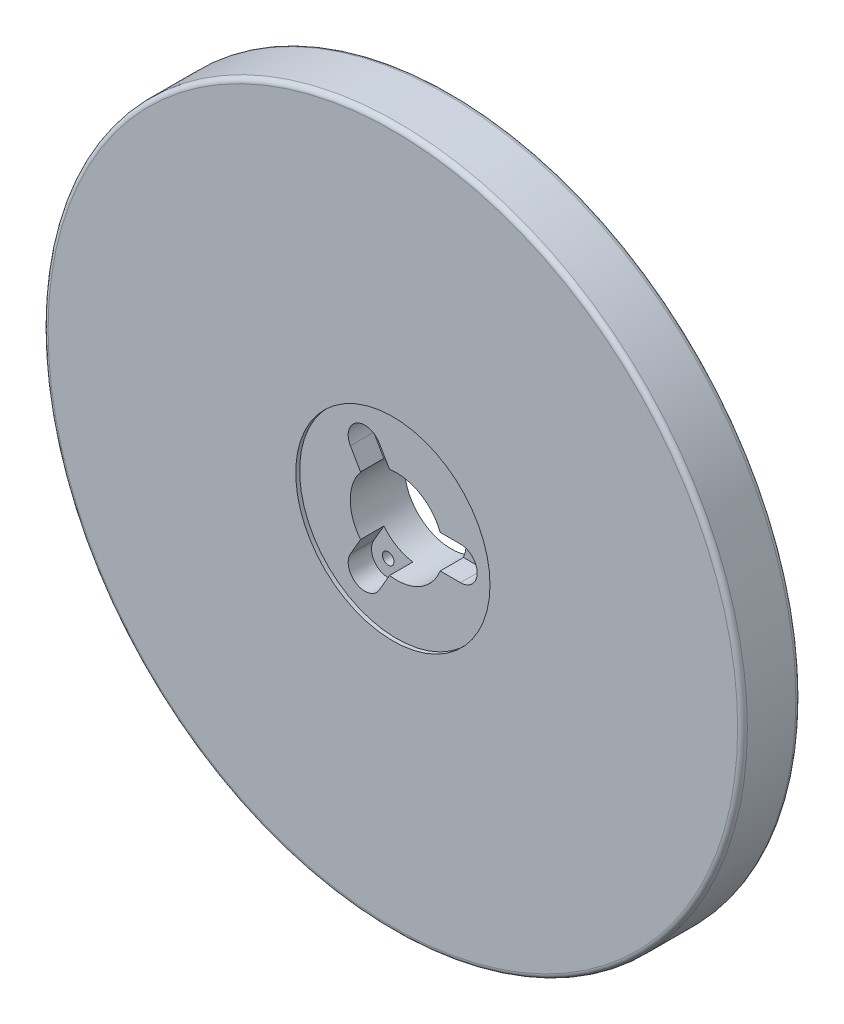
ISO-10303-21;
HEADER;
FILE_DESCRIPTION(('STEP AP214'),'2;1');
FILE_NAME('part.step','',(''),(''),'','','');
FILE_SCHEMA(('AUTOMOTIVE_DESIGN { 1 0 10303 214 1 1 1 1 }'));
ENDSEC;
DATA;
#1=APPLICATION_CONTEXT('core data for automotive mechanical design processes');
#2=APPLICATION_PROTOCOL_DEFINITION('international standard','automotive_design',2000,#1);
#3=PRODUCT_CONTEXT('',#1,'mechanical');
#4=PRODUCT('Part','Part','',(#3));
#5=PRODUCT_RELATED_PRODUCT_CATEGORY('part','',(#4));
#6=PRODUCT_DEFINITION_FORMATION('','',#4);
#7=PRODUCT_DEFINITION_CONTEXT('part definition',#1,'design');
#8=PRODUCT_DEFINITION('design','',#6,#7);
#9=PRODUCT_DEFINITION_SHAPE('','',#8);
#10=(LENGTH_UNIT() NAMED_UNIT(*) SI_UNIT(.MILLI.,.METRE.));
#11=(NAMED_UNIT(*) PLANE_ANGLE_UNIT() SI_UNIT($,.RADIAN.));
#12=(NAMED_UNIT(*) SI_UNIT($,.STERADIAN.) SOLID_ANGLE_UNIT());
#13=UNCERTAINTY_MEASURE_WITH_UNIT(LENGTH_MEASURE(1.E-05),#10,'distance_accuracy_value','');
#14=(GEOMETRIC_REPRESENTATION_CONTEXT(3) GLOBAL_UNCERTAINTY_ASSIGNED_CONTEXT((#13)) GLOBAL_UNIT_ASSIGNED_CONTEXT((#10,
#11,#12)) REPRESENTATION_CONTEXT('',''));
#15=CARTESIAN_POINT('',(0.,0.,0.));
#16=DIRECTION('',(0.,0.,1.));
#17=DIRECTION('',(1.,0.,0.));
#18=AXIS2_PLACEMENT_3D('',#15,#16,#17);
#19=CARTESIAN_POINT('',(0.,0.,-19.05));
#20=DIRECTION('',(0.,0.,1.));
#21=DIRECTION('',(1.,0.,0.));
#22=AXIS2_PLACEMENT_3D('',#19,#20,#21);
#23=CYLINDRICAL_SURFACE('',#22,30.4165);
#24=CARTESIAN_POINT('',(0.,0.,16.51));
#25=DIRECTION('',(0.,0.,1.));
#26=DIRECTION('',(1.,0.,0.));
#27=AXIS2_PLACEMENT_3D('',#24,#25,#26);
#28=CIRCLE('',#27,30.4165);
#29=CARTESIAN_POINT('',(-23.6526840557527,-19.1236505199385,16.51));
#30=VERTEX_POINT('',#29);
#31=CARTESIAN_POINT('',(-23.652684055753,19.123650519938,16.51));
#32=VERTEX_POINT('',#31);
#33=EDGE_CURVE('E228',#30,#32,#28,.F.);
#34=ORIENTED_EDGE('',*,*,#33,.F.);
#35=DIRECTION('',(0.,0.,1.));
#36=VECTOR('',#35,1.);
#37=CARTESIAN_POINT('',(-23.6526840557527,-19.1236505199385,1.27));
#38=LINE('',#37,#36);
#39=CARTESIAN_POINT('',(-23.6526840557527,-19.1236505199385,1.27));
#40=VERTEX_POINT('',#39);
#41=EDGE_CURVE('E151',#40,#30,#38,.T.);
#42=ORIENTED_EDGE('',*,*,#41,.F.);
#43=CARTESIAN_POINT('',(0.,0.,1.27));
#44=DIRECTION('',(0.,0.,1.));
#45=DIRECTION('',(1.,0.,0.));
#46=AXIS2_PLACEMENT_3D('',#43,#44,#45);
#47=CIRCLE('',#46,30.4165);
#48=CARTESIAN_POINT('',(-4.73522513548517,-30.0456505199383,1.27));
#49=VERTEX_POINT('',#48);
#50=EDGE_CURVE('E11',#49,#40,#47,.F.);
#51=ORIENTED_EDGE('',*,*,#50,.F.);
#52=DIRECTION('',(0.,0.,1.));
#53=VECTOR('',#52,1.);
#54=CARTESIAN_POINT('',(-4.73522513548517,-30.0456505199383,1.27));
#55=LINE('',#54,#53);
#56=CARTESIAN_POINT('',(-4.73522513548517,-30.0456505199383,16.51));
#57=VERTEX_POINT('',#56);
#58=EDGE_CURVE('E128',#49,#57,#55,.T.);
#59=ORIENTED_EDGE('',*,*,#58,.T.);
#60=CARTESIAN_POINT('',(28.3879091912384,-10.922,16.51));
#61=VERTEX_POINT('',#60);
#62=EDGE_CURVE('E213',#61,#57,#28,.F.);
#63=ORIENTED_EDGE('',*,*,#62,.F.);
#64=DIRECTION('',(0.,0.,1.));
#65=VECTOR('',#64,1.);
#66=CARTESIAN_POINT('',(28.3879091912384,-10.922,1.27));
#67=LINE('',#66,#65);
#68=CARTESIAN_POINT('',(28.3879091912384,-10.922,1.27));
#69=VERTEX_POINT('',#68);
#70=EDGE_CURVE('E197',#69,#61,#67,.T.);
#71=ORIENTED_EDGE('',*,*,#70,.F.);
#72=CARTESIAN_POINT('',(0.,0.,1.27));
#73=DIRECTION('',(0.,0.,1.));
#74=DIRECTION('',(1.,0.,0.));
#75=AXIS2_PLACEMENT_3D('',#72,#73,#74);
#76=CIRCLE('',#75,30.4165);
#77=CARTESIAN_POINT('',(28.3879091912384,10.9220000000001,1.27));
#78=VERTEX_POINT('',#77);
#79=EDGE_CURVE('E236',#78,#69,#76,.F.);
#80=ORIENTED_EDGE('',*,*,#79,.F.);
#81=DIRECTION('',(0.,0.,1.));
#82=VECTOR('',#81,1.);
#83=CARTESIAN_POINT('',(28.3879091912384,10.9220000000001,1.27));
#84=LINE('',#83,#82);
#85=CARTESIAN_POINT('',(28.3879091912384,10.9220000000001,16.51));
#86=VERTEX_POINT('',#85);
#87=EDGE_CURVE('E199',#78,#86,#84,.T.);
#88=ORIENTED_EDGE('',*,*,#87,.T.);
#89=CARTESIAN_POINT('',(-4.73522513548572,30.0456505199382,16.51));
#90=VERTEX_POINT('',#89);
#91=EDGE_CURVE('E208',#90,#86,#28,.F.);
#92=ORIENTED_EDGE('',*,*,#91,.F.);
#93=DIRECTION('',(0.,0.,1.));
#94=VECTOR('',#93,1.);
#95=CARTESIAN_POINT('',(-4.73522513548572,30.0456505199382,1.27));
#96=LINE('',#95,#94);
#97=CARTESIAN_POINT('',(-4.73522513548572,30.0456505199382,1.27));
#98=VERTEX_POINT('',#97);
#99=EDGE_CURVE('E166',#98,#90,#96,.T.);
#100=ORIENTED_EDGE('',*,*,#99,.F.);
#101=CARTESIAN_POINT('',(0.,0.,1.27));
#102=DIRECTION('',(0.,0.,1.));
#103=DIRECTION('',(1.,0.,0.));
#104=AXIS2_PLACEMENT_3D('',#101,#102,#103);
#105=CIRCLE('',#104,30.4165);
#106=CARTESIAN_POINT('',(-23.652684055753,19.123650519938,1.27));
#107=VERTEX_POINT('',#106);
#108=EDGE_CURVE('E244',#107,#98,#105,.F.);
#109=ORIENTED_EDGE('',*,*,#108,.F.);
#110=DIRECTION('',(0.,0.,1.));
#111=VECTOR('',#110,1.);
#112=CARTESIAN_POINT('',(-23.652684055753,19.123650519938,1.27));
#113=LINE('',#112,#111);
#114=EDGE_CURVE('E168',#107,#32,#113,.T.);
#115=ORIENTED_EDGE('',*,*,#114,.T.);
#116=EDGE_LOOP('',(#34,#42,#51,#59,#63,#71,#80,#88,#92,#100,#109,#115));
#117=FACE_BOUND('',#116,.T.);
#118=CARTESIAN_POINT('',(0.,0.,-19.05));
#119=DIRECTION('',(0.,0.,1.));
#120=DIRECTION('',(1.,0.,0.));
#121=AXIS2_PLACEMENT_3D('',#118,#119,#120);
#122=CIRCLE('',#121,30.4165);
#123=CARTESIAN_POINT('',(30.4165,0.,-19.05));
#124=VERTEX_POINT('',#123);
#125=EDGE_CURVE('E209',#124,#124,#122,.T.);
#126=ORIENTED_EDGE('',*,*,#125,.F.);
#127=EDGE_LOOP('',(#126));
#128=FACE_BOUND('',#127,.T.);
#129=ADVANCED_FACE('F32',(#117,#128),#23,.F.);
#130=CARTESIAN_POINT('',(0.,0.,19.05));
#131=DIRECTION('',(0.,0.,-1.));
#132=DIRECTION('',(-1.,0.,0.));
#133=AXIS2_PLACEMENT_3D('',#130,#131,#132);
#134=CYLINDRICAL_SURFACE('',#133,228.6);
#135=CARTESIAN_POINT('',(0.,0.,-15.875));
#136=DIRECTION('',(0.,0.,1.));
#137=DIRECTION('',(1.,0.,0.));
#138=AXIS2_PLACEMENT_3D('',#135,#136,#137);
#139=CIRCLE('',#138,228.6);
#140=CARTESIAN_POINT('',(-228.6,0.,-15.875));
#141=VERTEX_POINT('',#140);
#142=EDGE_CURVE('E219',#141,#141,#139,.T.);
#143=CARTESIAN_POINT('',(0.,0.,15.875));
#144=DIRECTION('',(0.,0.,1.));
#145=DIRECTION('',(1.,0.,0.));
#146=AXIS2_PLACEMENT_3D('',#143,#144,#145);
#147=CIRCLE('',#146,228.6);
#148=CARTESIAN_POINT('',(-228.6,0.,15.875));
#149=VERTEX_POINT('',#148);
#150=EDGE_CURVE('E216',#149,#149,#147,.F.);
#151=CARTESIAN_POINT('',(-228.6,0.,-15.875));
#152=CARTESIAN_POINT('',(-228.6,0.,-15.5442708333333));
#153=CARTESIAN_POINT('',(-228.6,0.,-15.2135416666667));
#154=CARTESIAN_POINT('',(-228.6,0.,-14.5520833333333));
#155=CARTESIAN_POINT('',(-228.6,0.,-14.2213541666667));
#156=CARTESIAN_POINT('',(-228.6,0.,-13.5598958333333));
#157=CARTESIAN_POINT('',(-228.6,0.,-13.2291666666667));
#158=CARTESIAN_POINT('',(-228.6,0.,-12.5677083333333));
#159=CARTESIAN_POINT('',(-228.6,0.,-12.2369791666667));
#160=CARTESIAN_POINT('',(-228.6,0.,-11.5755208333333));
#161=CARTESIAN_POINT('',(-228.6,0.,-11.2447916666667));
#162=CARTESIAN_POINT('',(-228.6,0.,-10.5833333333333));
#163=CARTESIAN_POINT('',(-228.6,0.,-10.2526041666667));
#164=CARTESIAN_POINT('',(-228.6,0.,-9.59114583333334));
#165=CARTESIAN_POINT('',(-228.6,0.,-9.26041666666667));
#166=CARTESIAN_POINT('',(-228.6,0.,-8.59895833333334));
#167=CARTESIAN_POINT('',(-228.6,0.,-8.26822916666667));
#168=CARTESIAN_POINT('',(-228.6,0.,-7.60677083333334));
#169=CARTESIAN_POINT('',(-228.6,0.,-7.27604166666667));
#170=CARTESIAN_POINT('',(-228.6,0.,-6.61458333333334));
#171=CARTESIAN_POINT('',(-228.6,0.,-6.28385416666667));
#172=CARTESIAN_POINT('',(-228.6,0.,-5.62239583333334));
#173=CARTESIAN_POINT('',(-228.6,0.,-5.29166666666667));
#174=CARTESIAN_POINT('',(-228.6,0.,-4.63020833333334));
#175=CARTESIAN_POINT('',(-228.6,0.,-4.29947916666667));
#176=CARTESIAN_POINT('',(-228.6,0.,-3.63802083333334));
#177=CARTESIAN_POINT('',(-228.6,0.,-3.30729166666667));
#178=CARTESIAN_POINT('',(-228.6,0.,-2.64583333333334));
#179=CARTESIAN_POINT('',(-228.6,0.,-2.31510416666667));
#180=CARTESIAN_POINT('',(-228.6,0.,-1.65364583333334));
#181=CARTESIAN_POINT('',(-228.6,0.,-1.32291666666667));
#182=CARTESIAN_POINT('',(-228.6,0.,-0.661458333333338));
#183=CARTESIAN_POINT('',(-228.6,0.,-0.330729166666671));
#184=CARTESIAN_POINT('',(-228.6,0.,0.330729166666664));
#185=CARTESIAN_POINT('',(-228.6,0.,0.661458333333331));
#186=CARTESIAN_POINT('',(-228.6,0.,1.32291666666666));
#187=CARTESIAN_POINT('',(-228.6,0.,1.65364583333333));
#188=CARTESIAN_POINT('',(-228.6,0.,2.31510416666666));
#189=CARTESIAN_POINT('',(-228.6,0.,2.64583333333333));
#190=CARTESIAN_POINT('',(-228.6,0.,3.30729166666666));
#191=CARTESIAN_POINT('',(-228.6,0.,3.63802083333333));
#192=CARTESIAN_POINT('',(-228.6,0.,4.29947916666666));
#193=CARTESIAN_POINT('',(-228.6,0.,4.63020833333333));
#194=CARTESIAN_POINT('',(-228.6,0.,5.29166666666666));
#195=CARTESIAN_POINT('',(-228.6,0.,5.62239583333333));
#196=CARTESIAN_POINT('',(-228.6,0.,6.28385416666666));
#197=CARTESIAN_POINT('',(-228.6,0.,6.61458333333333));
#198=CARTESIAN_POINT('',(-228.6,0.,7.27604166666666));
#199=CARTESIAN_POINT('',(-228.6,0.,7.60677083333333));
#200=CARTESIAN_POINT('',(-228.6,0.,8.26822916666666));
#201=CARTESIAN_POINT('',(-228.6,0.,8.59895833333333));
#202=CARTESIAN_POINT('',(-228.6,0.,9.26041666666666));
#203=CARTESIAN_POINT('',(-228.6,0.,9.59114583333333));
#204=CARTESIAN_POINT('',(-228.6,0.,10.2526041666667));
#205=CARTESIAN_POINT('',(-228.6,0.,10.5833333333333));
#206=CARTESIAN_POINT('',(-228.6,0.,11.2447916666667));
#207=CARTESIAN_POINT('',(-228.6,0.,11.5755208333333));
#208=CARTESIAN_POINT('',(-228.6,0.,12.2369791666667));
#209=CARTESIAN_POINT('',(-228.6,0.,12.5677083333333));
#210=CARTESIAN_POINT('',(-228.6,0.,13.2291666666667));
#211=CARTESIAN_POINT('',(-228.6,0.,13.5598958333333));
#212=CARTESIAN_POINT('',(-228.6,0.,14.2213541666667));
#213=CARTESIAN_POINT('',(-228.6,0.,14.5520833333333));
#214=CARTESIAN_POINT('',(-228.6,0.,15.2135416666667));
#215=CARTESIAN_POINT('',(-228.6,0.,15.5442708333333));
#216=CARTESIAN_POINT('',(-228.6,0.,15.875));
#217=B_SPLINE_CURVE_WITH_KNOTS('',3,(#151,#152,#153,#154,#155,#156,#157,#158,#159,#160,#161,
#162,#163,#164,#165,#166,#167,#168,#169,#170,#171,#172,#173,#174,#175,#176,#177,#178,#179,#180,
#181,#182,#183,#184,#185,#186,#187,#188,#189,#190,#191,#192,#193,#194,#195,#196,#197,#198,#199,
#200,#201,#202,#203,#204,#205,#206,#207,#208,#209,#210,#211,#212,#213,#214,#215,#216),
.UNSPECIFIED.,.F.,.F.,(4,2,2,2,2,2,2,2,2,2,2,2,2,2,2,2,2,2,2,2,2,2,2,2,2,2,2,2,2,2,2,2,4),(0.,
0.992187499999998,1.984375,2.9765625,3.96875,4.9609375,5.953125,6.9453125,7.9375,8.9296875,
9.921875,10.9140625,11.90625,12.8984375,13.890625,14.8828125,15.875,16.8671875,17.859375,
18.8515625,19.84375,20.8359375,21.828125,22.8203125,23.8125,24.8046875,25.796875,26.7890625,
27.78125,28.7734375,29.765625,30.7578125,31.75),.UNSPECIFIED.);
#218=EDGE_CURVE('BSEAM34',#141,#149,#217,.T.);
#219=ORIENTED_EDGE('',*,*,#142,.T.);
#220=ORIENTED_EDGE('',*,*,#150,.T.);
#221=ORIENTED_EDGE('',*,*,#218,.T.);
#222=ORIENTED_EDGE('',*,*,#218,.F.);
#223=EDGE_LOOP('',(#219,#221,#220,#222));
#224=FACE_BOUND('',#223,.T.);
#225=ADVANCED_FACE('F34',(#224),#134,.T.);
#226=CARTESIAN_POINT('',(0.,0.,19.05));
#227=DIRECTION('',(0.,0.,1.));
#228=DIRECTION('',(1.,0.,0.));
#229=AXIS2_PLACEMENT_3D('',#226,#227,#228);
#230=PLANE('',#229);
#231=CARTESIAN_POINT('',(0.,0.,19.05));
#232=DIRECTION('',(0.,0.,1.));
#233=DIRECTION('',(1.,0.,0.));
#234=AXIS2_PLACEMENT_3D('',#231,#232,#233);
#235=CIRCLE('',#234,63.5);
#236=CARTESIAN_POINT('',(63.5,0.,19.05));
#237=VERTEX_POINT('',#236);
#238=EDGE_CURVE('E196',#237,#237,#235,.T.);
#239=ORIENTED_EDGE('',*,*,#238,.F.);
#240=EDGE_LOOP('',(#239));
#241=FACE_BOUND('',#240,.T.);
#242=CARTESIAN_POINT('',(0.,0.,19.05));
#243=DIRECTION('',(0.,0.,1.));
#244=DIRECTION('',(1.,0.,0.));
#245=AXIS2_PLACEMENT_3D('',#242,#243,#244);
#246=CIRCLE('',#245,225.425);
#247=CARTESIAN_POINT('',(225.425,0.,19.05));
#248=VERTEX_POINT('',#247);
#249=EDGE_CURVE('E212',#248,#248,#246,.T.);
#250=ORIENTED_EDGE('',*,*,#249,.T.);
#251=EDGE_LOOP('',(#250));
#252=FACE_BOUND('',#251,.T.);
#253=ADVANCED_FACE('F298',(#241,#252),#230,.T.);
#254=CARTESIAN_POINT('',(0.,0.,-19.05));
#255=DIRECTION('',(0.,0.,1.));
#256=DIRECTION('',(1.,0.,0.));
#257=AXIS2_PLACEMENT_3D('',#254,#255,#256);
#258=PLANE('',#257);
#259=CARTESIAN_POINT('',(-20.8279999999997,-36.0751542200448,-19.05));
#260=DIRECTION('',(0.,0.,-1.));
#261=DIRECTION('',(0.499999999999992,0.866025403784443,0.));
#262=AXIS2_PLACEMENT_3D('',#259,#260,#261);
#263=CIRCLE('',#262,9.525);
#264=CARTESIAN_POINT('',(-16.0654999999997,-27.8262622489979,-19.05));
#265=VERTEX_POINT('',#264);
#266=EDGE_CURVE('E566',#265,#265,#263,.T.);
#267=ORIENTED_EDGE('',*,*,#266,.F.);
#268=EDGE_LOOP('',(#267));
#269=FACE_BOUND('',#268,.T.);
#270=CARTESIAN_POINT('',(-20.8280000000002,36.0751542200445,-19.05));
#271=DIRECTION('',(0.,0.,-1.));
#272=DIRECTION('',(0.500000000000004,-0.866025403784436,0.));
#273=AXIS2_PLACEMENT_3D('',#270,#271,#272);
#274=CIRCLE('',#273,9.525);
#275=CARTESIAN_POINT('',(-16.0655000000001,27.8262622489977,-19.05));
#276=VERTEX_POINT('',#275);
#277=EDGE_CURVE('E143',#276,#276,#274,.T.);
#278=ORIENTED_EDGE('',*,*,#277,.F.);
#279=EDGE_LOOP('',(#278));
#280=FACE_BOUND('',#279,.T.);
#281=CARTESIAN_POINT('',(41.656,0.,-19.05));
#282=DIRECTION('',(0.,0.,-1.));
#283=DIRECTION('',(-1.,0.,0.));
#284=AXIS2_PLACEMENT_3D('',#281,#282,#283);
#285=CIRCLE('',#284,9.525);
#286=CARTESIAN_POINT('',(32.131,0.,-19.05));
#287=VERTEX_POINT('',#286);
#288=EDGE_CURVE('E177',#287,#287,#285,.T.);
#289=ORIENTED_EDGE('',*,*,#288,.F.);
#290=EDGE_LOOP('',(#289));
#291=FACE_BOUND('',#290,.T.);
#292=CARTESIAN_POINT('',(0.,0.,-19.05));
#293=DIRECTION('',(0.,0.,1.));
#294=DIRECTION('',(1.,0.,0.));
#295=AXIS2_PLACEMENT_3D('',#292,#293,#294);
#296=CIRCLE('',#295,225.425);
#297=CARTESIAN_POINT('',(225.425,0.,-19.05));
#298=VERTEX_POINT('',#297);
#299=EDGE_CURVE('E222',#298,#298,#296,.F.);
#300=ORIENTED_EDGE('',*,*,#299,.T.);
#301=EDGE_LOOP('',(#300));
#302=FACE_BOUND('',#301,.T.);
#303=ORIENTED_EDGE('',*,*,#125,.T.);
#304=EDGE_LOOP('',(#303));
#305=FACE_BOUND('',#304,.T.);
#306=ADVANCED_FACE('F304',(#269,#280,#291,#302,#305),#258,.F.);
#307=CARTESIAN_POINT('',(0.,0.,15.875));
#308=DIRECTION('',(0.,0.,1.));
#309=DIRECTION('',(1.,0.,0.));
#310=AXIS2_PLACEMENT_3D('',#307,#308,#309);
#311=TOROIDAL_SURFACE('',#310,225.425,3.175);
#312=ORIENTED_EDGE('',*,*,#150,.F.);
#313=EDGE_LOOP('',(#312));
#314=FACE_BOUND('',#313,.T.);
#315=ORIENTED_EDGE('',*,*,#249,.F.);
#316=EDGE_LOOP('',(#315));
#317=FACE_BOUND('',#316,.T.);
#318=ADVANCED_FACE('F302',(#314,#317),#311,.T.);
#319=CARTESIAN_POINT('',(0.,0.,-15.875));
#320=DIRECTION('',(0.,0.,1.));
#321=DIRECTION('',(1.,0.,0.));
#322=AXIS2_PLACEMENT_3D('',#319,#320,#321);
#323=TOROIDAL_SURFACE('',#322,225.425,3.175);
#324=ORIENTED_EDGE('',*,*,#299,.F.);
#325=EDGE_LOOP('',(#324));
#326=FACE_BOUND('',#325,.T.);
#327=ORIENTED_EDGE('',*,*,#142,.F.);
#328=EDGE_LOOP('',(#327));
#329=FACE_BOUND('',#328,.T.);
#330=ADVANCED_FACE('F316',(#326,#329),#323,.T.);
#331=CARTESIAN_POINT('',(0.,0.,16.51));
#332=DIRECTION('',(0.,0.,1.));
#333=DIRECTION('',(1.,0.,0.));
#334=AXIS2_PLACEMENT_3D('',#331,#332,#333);
#335=PLANE('',#334);
#336=DIRECTION('',(-0.499999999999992,-0.866025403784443,0.));
#337=VECTOR('',#336,1.);
#338=CARTESIAN_POINT('',(-9.45872946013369,5.46099999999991,16.51));
#339=LINE('',#338,#337);
#340=CARTESIAN_POINT('',(-30.2867294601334,-30.6141542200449,16.51));
#341=VERTEX_POINT('',#340);
#342=EDGE_CURVE('E40',#30,#341,#339,.T.);
#343=ORIENTED_EDGE('',*,*,#342,.F.);
#344=ORIENTED_EDGE('',*,*,#33,.T.);
#345=DIRECTION('',(0.499999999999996,-0.866025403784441,0.));
#346=VECTOR('',#345,1.);
#347=CARTESIAN_POINT('',(-9.458729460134,-5.46100000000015,16.51));
#348=LINE('',#347,#346);
#349=CARTESIAN_POINT('',(-30.2867294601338,30.6141542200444,16.51));
#350=VERTEX_POINT('',#349);
#351=EDGE_CURVE('E238',#350,#32,#348,.T.);
#352=ORIENTED_EDGE('',*,*,#351,.F.);
#353=CARTESIAN_POINT('',(-20.8280000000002,36.0751542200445,16.51));
#354=DIRECTION('',(0.,0.,1.));
#355=DIRECTION('',(1.,0.,0.));
#356=AXIS2_PLACEMENT_3D('',#353,#354,#355);
#357=CIRCLE('',#356,10.922);
#358=CARTESIAN_POINT('',(-11.3692705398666,41.5361542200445,16.51));
#359=VERTEX_POINT('',#358);
#360=EDGE_CURVE('E240',#359,#350,#357,.T.);
#361=ORIENTED_EDGE('',*,*,#360,.F.);
#362=DIRECTION('',(-0.500000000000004,0.866025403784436,0.));
#363=VECTOR('',#362,1.);
#364=CARTESIAN_POINT('',(9.45872946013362,5.46100000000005,16.51));
#365=LINE('',#364,#363);
#366=EDGE_CURVE('E242',#90,#359,#365,.T.);
#367=ORIENTED_EDGE('',*,*,#366,.F.);
#368=ORIENTED_EDGE('',*,*,#91,.T.);
#369=DIRECTION('',(-1.,0.,0.));
#370=VECTOR('',#369,1.);
#371=CARTESIAN_POINT('',(1.01387016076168E-13,10.9220000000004,16.51));
#372=LINE('',#371,#370);
#373=CARTESIAN_POINT('',(41.656,10.922,16.51));
#374=VERTEX_POINT('',#373);
#375=EDGE_CURVE('E225',#374,#86,#372,.T.);
#376=ORIENTED_EDGE('',*,*,#375,.F.);
#377=CARTESIAN_POINT('',(41.656,0.,16.51));
#378=DIRECTION('',(0.,0.,1.));
#379=DIRECTION('',(1.,0.,0.));
#380=AXIS2_PLACEMENT_3D('',#377,#378,#379);
#381=CIRCLE('',#380,10.922);
#382=CARTESIAN_POINT('',(41.656,-10.922,16.51));
#383=VERTEX_POINT('',#382);
#384=EDGE_CURVE('E231',#383,#374,#381,.T.);
#385=ORIENTED_EDGE('',*,*,#384,.F.);
#386=DIRECTION('',(1.,0.,0.));
#387=VECTOR('',#386,1.);
#388=CARTESIAN_POINT('',(0.,-10.922,16.51));
#389=LINE('',#388,#387);
#390=EDGE_CURVE('E234',#61,#383,#389,.T.);
#391=ORIENTED_EDGE('',*,*,#390,.F.);
#392=ORIENTED_EDGE('',*,*,#62,.T.);
#393=DIRECTION('',(0.5,0.866025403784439,0.));
#394=VECTOR('',#393,1.);
#395=CARTESIAN_POINT('',(9.45872946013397,-5.46100000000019,16.51));
#396=LINE('',#395,#394);
#397=CARTESIAN_POINT('',(-11.369270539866,-41.5361542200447,16.51));
#398=VERTEX_POINT('',#397);
#399=EDGE_CURVE('E246',#398,#57,#396,.T.);
#400=ORIENTED_EDGE('',*,*,#399,.F.);
#401=CARTESIAN_POINT('',(-20.8279999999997,-36.0751542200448,16.51));
#402=DIRECTION('',(0.,0.,1.));
#403=DIRECTION('',(1.,0.,0.));
#404=AXIS2_PLACEMENT_3D('',#401,#402,#403);
#405=CIRCLE('',#404,10.922);
#406=EDGE_CURVE('E126',#341,#398,#405,.T.);
#407=ORIENTED_EDGE('',*,*,#406,.F.);
#408=EDGE_LOOP('',(#343,#344,#352,#361,#367,#368,#376,#385,#391,#392,#400,#407));
#409=FACE_BOUND('',#408,.T.);
#410=CARTESIAN_POINT('',(0.,0.,16.51));
#411=DIRECTION('',(0.,0.,1.));
#412=DIRECTION('',(1.,0.,0.));
#413=AXIS2_PLACEMENT_3D('',#410,#411,#412);
#414=CIRCLE('',#413,63.5);
#415=CARTESIAN_POINT('',(63.5,0.,16.51));
#416=VERTEX_POINT('',#415);
#417=EDGE_CURVE('E205',#416,#416,#414,.T.);
#418=ORIENTED_EDGE('',*,*,#417,.T.);
#419=EDGE_LOOP('',(#418));
#420=FACE_BOUND('',#419,.T.);
#421=ADVANCED_FACE('F254',(#409,#420),#335,.T.);
#422=CARTESIAN_POINT('',(0.,0.,16.51));
#423=DIRECTION('',(0.,0.,1.));
#424=DIRECTION('',(1.,0.,0.));
#425=AXIS2_PLACEMENT_3D('',#422,#423,#424);
#426=CYLINDRICAL_SURFACE('',#425,63.5);
#427=ORIENTED_EDGE('',*,*,#417,.F.);
#428=EDGE_LOOP('',(#427));
#429=FACE_BOUND('',#428,.T.);
#430=ORIENTED_EDGE('',*,*,#238,.T.);
#431=EDGE_LOOP('',(#430));
#432=FACE_BOUND('',#431,.T.);
#433=ADVANCED_FACE('F288',(#429,#432),#426,.F.);
#434=CARTESIAN_POINT('',(41.656,0.,1.27));
#435=DIRECTION('',(0.,0.,1.));
#436=DIRECTION('',(1.,0.,0.));
#437=AXIS2_PLACEMENT_3D('',#434,#435,#436);
#438=PLANE('',#437);
#439=CARTESIAN_POINT('',(41.656,0.,1.27));
#440=DIRECTION('',(0.,0.,1.));
#441=DIRECTION('',(1.,0.,0.));
#442=AXIS2_PLACEMENT_3D('',#439,#440,#441);
#443=CIRCLE('',#442,3.81);
#444=CARTESIAN_POINT('',(37.846,0.,1.27));
#445=VERTEX_POINT('',#444);
#446=EDGE_CURVE('E174',#445,#445,#443,.T.);
#447=ORIENTED_EDGE('',*,*,#446,.F.);
#448=EDGE_LOOP('',(#447));
#449=FACE_BOUND('',#448,.T.);
#450=ORIENTED_EDGE('',*,*,#79,.T.);
#451=DIRECTION('',(1.,0.,0.));
#452=VECTOR('',#451,1.);
#453=CARTESIAN_POINT('',(41.656,-10.922,1.27));
#454=LINE('',#453,#452);
#455=CARTESIAN_POINT('',(41.656,-10.922,1.27));
#456=VERTEX_POINT('',#455);
#457=EDGE_CURVE('E189',#69,#456,#454,.T.);
#458=ORIENTED_EDGE('',*,*,#457,.T.);
#459=CARTESIAN_POINT('',(41.656,0.,1.27));
#460=DIRECTION('',(0.,0.,1.));
#461=DIRECTION('',(1.,0.,0.));
#462=AXIS2_PLACEMENT_3D('',#459,#460,#461);
#463=CIRCLE('',#462,10.922);
#464=CARTESIAN_POINT('',(41.656,10.922,1.27));
#465=VERTEX_POINT('',#464);
#466=EDGE_CURVE('E183',#456,#465,#463,.T.);
#467=ORIENTED_EDGE('',*,*,#466,.T.);
#468=DIRECTION('',(-1.,0.,0.));
#469=VECTOR('',#468,1.);
#470=CARTESIAN_POINT('',(41.656,10.922,1.27));
#471=LINE('',#470,#469);
#472=EDGE_CURVE('E186',#465,#78,#471,.T.);
#473=ORIENTED_EDGE('',*,*,#472,.T.);
#474=EDGE_LOOP('',(#450,#458,#467,#473));
#475=FACE_BOUND('',#474,.T.);
#476=ADVANCED_FACE('F275',(#449,#475),#438,.T.);
#477=CARTESIAN_POINT('',(41.656,0.,1.27));
#478=DIRECTION('',(0.,0.,1.));
#479=DIRECTION('',(1.,0.,0.));
#480=AXIS2_PLACEMENT_3D('',#477,#478,#479);
#481=CYLINDRICAL_SURFACE('',#480,10.922);
#482=ORIENTED_EDGE('',*,*,#384,.T.);
#483=DIRECTION('',(0.,0.,1.));
#484=VECTOR('',#483,1.);
#485=CARTESIAN_POINT('',(41.656,10.922,1.27));
#486=LINE('',#485,#484);
#487=EDGE_CURVE('E192',#465,#374,#486,.T.);
#488=ORIENTED_EDGE('',*,*,#487,.F.);
#489=ORIENTED_EDGE('',*,*,#466,.F.);
#490=DIRECTION('',(0.,0.,1.));
#491=VECTOR('',#490,1.);
#492=CARTESIAN_POINT('',(41.656,-10.922,1.27));
#493=LINE('',#492,#491);
#494=EDGE_CURVE('E193',#456,#383,#493,.T.);
#495=ORIENTED_EDGE('',*,*,#494,.T.);
#496=EDGE_LOOP('',(#482,#488,#489,#495));
#497=FACE_BOUND('',#496,.T.);
#498=ADVANCED_FACE('F280',(#497),#481,.F.);
#499=CARTESIAN_POINT('',(41.656,-10.922,1.27));
#500=DIRECTION('',(0.,-1.,0.));
#501=DIRECTION('',(0.,0.,-1.));
#502=AXIS2_PLACEMENT_3D('',#499,#500,#501);
#503=PLANE('',#502);
#504=ORIENTED_EDGE('',*,*,#390,.T.);
#505=ORIENTED_EDGE('',*,*,#494,.F.);
#506=ORIENTED_EDGE('',*,*,#457,.F.);
#507=ORIENTED_EDGE('',*,*,#70,.T.);
#508=EDGE_LOOP('',(#504,#505,#506,#507));
#509=FACE_BOUND('',#508,.T.);
#510=ADVANCED_FACE('F277',(#509),#503,.F.);
#511=CARTESIAN_POINT('',(41.656,10.922,1.27));
#512=DIRECTION('',(0.,1.,0.));
#513=DIRECTION('',(-1.,0.,0.));
#514=AXIS2_PLACEMENT_3D('',#511,#512,#513);
#515=PLANE('',#514);
#516=ORIENTED_EDGE('',*,*,#375,.T.);
#517=ORIENTED_EDGE('',*,*,#87,.F.);
#518=ORIENTED_EDGE('',*,*,#472,.F.);
#519=ORIENTED_EDGE('',*,*,#487,.T.);
#520=EDGE_LOOP('',(#516,#517,#518,#519));
#521=FACE_BOUND('',#520,.T.);
#522=ADVANCED_FACE('F270',(#521),#515,.F.);
#523=CARTESIAN_POINT('',(41.656,0.,-6.35));
#524=DIRECTION('',(0.,0.,-1.));
#525=DIRECTION('',(-1.,0.,0.));
#526=AXIS2_PLACEMENT_3D('',#523,#524,#525);
#527=CYLINDRICAL_SURFACE('',#526,9.525);
#528=CARTESIAN_POINT('',(41.656,0.,-6.35));
#529=DIRECTION('',(0.,0.,-1.));
#530=DIRECTION('',(-1.,0.,0.));
#531=AXIS2_PLACEMENT_3D('',#528,#529,#530);
#532=CIRCLE('',#531,9.525);
#533=CARTESIAN_POINT('',(32.131,0.,-6.35));
#534=VERTEX_POINT('',#533);
#535=EDGE_CURVE('E180',#534,#534,#532,.T.);
#536=ORIENTED_EDGE('',*,*,#535,.F.);
#537=EDGE_LOOP('',(#536));
#538=FACE_BOUND('',#537,.T.);
#539=ORIENTED_EDGE('',*,*,#288,.T.);
#540=EDGE_LOOP('',(#539));
#541=FACE_BOUND('',#540,.T.);
#542=ADVANCED_FACE('F349',(#538,#541),#527,.F.);
#543=CARTESIAN_POINT('',(41.656,0.,-6.35));
#544=DIRECTION('',(0.,0.,-1.));
#545=DIRECTION('',(-1.,0.,0.));
#546=AXIS2_PLACEMENT_3D('',#543,#544,#545);
#547=PLANE('',#546);
#548=CARTESIAN_POINT('',(41.656,0.,-6.35));
#549=DIRECTION('',(0.,0.,-1.));
#550=DIRECTION('',(-1.,0.,0.));
#551=AXIS2_PLACEMENT_3D('',#548,#549,#550);
#552=CIRCLE('',#551,3.81);
#553=CARTESIAN_POINT('',(37.846,0.,-6.35));
#554=VERTEX_POINT('',#553);
#555=EDGE_CURVE('E165',#554,#554,#552,.T.);
#556=ORIENTED_EDGE('',*,*,#555,.F.);
#557=EDGE_LOOP('',(#556));
#558=FACE_BOUND('',#557,.T.);
#559=ORIENTED_EDGE('',*,*,#535,.T.);
#560=EDGE_LOOP('',(#559));
#561=FACE_BOUND('',#560,.T.);
#562=ADVANCED_FACE('F354',(#558,#561),#547,.T.);
#563=CARTESIAN_POINT('',(41.656,0.,19.05));
#564=DIRECTION('',(0.,0.,-1.));
#565=DIRECTION('',(-1.,0.,0.));
#566=AXIS2_PLACEMENT_3D('',#563,#564,#565);
#567=CYLINDRICAL_SURFACE('',#566,3.81);
#568=CARTESIAN_POINT('',(37.846,0.,1.27));
#569=CARTESIAN_POINT('',(37.846,0.,1.190625));
#570=CARTESIAN_POINT('',(37.846,0.,1.11125));
#571=CARTESIAN_POINT('',(37.846,0.,0.952500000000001));
#572=CARTESIAN_POINT('',(37.846,0.,0.873125));
#573=CARTESIAN_POINT('',(37.846,0.,0.714375));
#574=CARTESIAN_POINT('',(37.846,0.,0.635));
#575=CARTESIAN_POINT('',(37.846,0.,0.47625));
#576=CARTESIAN_POINT('',(37.846,0.,0.396874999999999));
#577=CARTESIAN_POINT('',(37.846,0.,0.238124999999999));
#578=CARTESIAN_POINT('',(37.846,0.,0.158749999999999));
#579=CARTESIAN_POINT('',(37.846,0.,0.));
#580=CARTESIAN_POINT('',(37.846,0.,-0.0793749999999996));
#581=CARTESIAN_POINT('',(37.846,0.,-0.238125));
#582=CARTESIAN_POINT('',(37.846,0.,-0.317500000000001));
#583=CARTESIAN_POINT('',(37.846,0.,-0.476250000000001));
#584=CARTESIAN_POINT('',(37.846,0.,-0.555625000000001));
#585=CARTESIAN_POINT('',(37.846,0.,-0.714375));
#586=CARTESIAN_POINT('',(37.846,0.,-0.793749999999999));
#587=CARTESIAN_POINT('',(37.846,0.,-0.9525));
#588=CARTESIAN_POINT('',(37.846,0.,-1.031875));
#589=CARTESIAN_POINT('',(37.846,0.,-1.190625));
#590=CARTESIAN_POINT('',(37.846,0.,-1.27));
#591=CARTESIAN_POINT('',(37.846,0.,-1.42875));
#592=CARTESIAN_POINT('',(37.846,0.,-1.508125));
#593=CARTESIAN_POINT('',(37.846,0.,-1.666875));
#594=CARTESIAN_POINT('',(37.846,0.,-1.74625));
#595=CARTESIAN_POINT('',(37.846,0.,-1.905));
#596=CARTESIAN_POINT('',(37.846,0.,-1.984375));
#597=CARTESIAN_POINT('',(37.846,0.,-2.143125));
#598=CARTESIAN_POINT('',(37.846,0.,-2.2225));
#599=CARTESIAN_POINT('',(37.846,0.,-2.38125));
#600=CARTESIAN_POINT('',(37.846,0.,-2.460625));
#601=CARTESIAN_POINT('',(37.846,0.,-2.619375));
#602=CARTESIAN_POINT('',(37.846,0.,-2.69875));
#603=CARTESIAN_POINT('',(37.846,0.,-2.8575));
#604=CARTESIAN_POINT('',(37.846,0.,-2.936875));
#605=CARTESIAN_POINT('',(37.846,0.,-3.095625));
#606=CARTESIAN_POINT('',(37.846,0.,-3.175));
#607=CARTESIAN_POINT('',(37.846,0.,-3.33375));
#608=CARTESIAN_POINT('',(37.846,0.,-3.413125));
#609=CARTESIAN_POINT('',(37.846,0.,-3.571875));
#610=CARTESIAN_POINT('',(37.846,0.,-3.65125));
#611=CARTESIAN_POINT('',(37.846,0.,-3.81));
#612=CARTESIAN_POINT('',(37.846,0.,-3.889375));
#613=CARTESIAN_POINT('',(37.846,0.,-4.048125));
#614=CARTESIAN_POINT('',(37.846,0.,-4.1275));
#615=CARTESIAN_POINT('',(37.846,0.,-4.28625));
#616=CARTESIAN_POINT('',(37.846,0.,-4.365625));
#617=CARTESIAN_POINT('',(37.846,0.,-4.524375));
#618=CARTESIAN_POINT('',(37.846,0.,-4.60375));
#619=CARTESIAN_POINT('',(37.846,0.,-4.7625));
#620=CARTESIAN_POINT('',(37.846,0.,-4.841875));
#621=CARTESIAN_POINT('',(37.846,0.,-5.000625));
#622=CARTESIAN_POINT('',(37.846,0.,-5.08));
#623=CARTESIAN_POINT('',(37.846,0.,-5.23875));
#624=CARTESIAN_POINT('',(37.846,0.,-5.318125));
#625=CARTESIAN_POINT('',(37.846,0.,-5.476875));
#626=CARTESIAN_POINT('',(37.846,0.,-5.55625));
#627=CARTESIAN_POINT('',(37.846,0.,-5.715));
#628=CARTESIAN_POINT('',(37.846,0.,-5.794375));
#629=CARTESIAN_POINT('',(37.846,0.,-5.953125));
#630=CARTESIAN_POINT('',(37.846,0.,-6.0325));
#631=CARTESIAN_POINT('',(37.846,0.,-6.19125));
#632=CARTESIAN_POINT('',(37.846,0.,-6.270625));
#633=CARTESIAN_POINT('',(37.846,0.,-6.35));
#634=B_SPLINE_CURVE_WITH_KNOTS('',3,(#568,#569,#570,#571,#572,#573,#574,#575,#576,#577,#578,
#579,#580,#581,#582,#583,#584,#585,#586,#587,#588,#589,#590,#591,#592,#593,#594,#595,#596,#597,
#598,#599,#600,#601,#602,#603,#604,#605,#606,#607,#608,#609,#610,#611,#612,#613,#614,#615,#616,
#617,#618,#619,#620,#621,#622,#623,#624,#625,#626,#627,#628,#629,#630,#631,#632,#633),
.UNSPECIFIED.,.F.,.F.,(4,2,2,2,2,2,2,2,2,2,2,2,2,2,2,2,2,2,2,2,2,2,2,2,2,2,2,2,2,2,2,2,4),(0.,
0.238124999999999,0.476250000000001,0.714375,0.952500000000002,1.190625,1.42875,1.666875,1.905,
2.143125,2.38125,2.619375,2.8575,3.095625,3.33375,3.571875,3.81,4.048125,4.28625,4.524375,
4.7625,5.000625,5.23875,5.476875,5.715,5.953125,6.19125,6.429375,6.6675,6.905625,7.14375,
7.381875,7.62),.UNSPECIFIED.);
#635=EDGE_CURVE('BSEAM359',#445,#554,#634,.T.);
#636=ORIENTED_EDGE('',*,*,#446,.T.);
#637=ORIENTED_EDGE('',*,*,#555,.T.);
#638=ORIENTED_EDGE('',*,*,#635,.T.);
#639=ORIENTED_EDGE('',*,*,#635,.F.);
#640=EDGE_LOOP('',(#636,#638,#637,#639));
#641=FACE_BOUND('',#640,.T.);
#642=ADVANCED_FACE('F359',(#641),#567,.F.);
#643=CARTESIAN_POINT('',(-20.8280000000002,36.0751542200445,1.27));
#644=DIRECTION('',(0.,0.,1.));
#645=DIRECTION('',(-0.500000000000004,0.866025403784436,0.));
#646=AXIS2_PLACEMENT_3D('',#643,#644,#645);
#647=PLANE('',#646);
#648=CARTESIAN_POINT('',(-20.8280000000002,36.0751542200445,1.27));
#649=DIRECTION('',(0.,0.,1.));
#650=DIRECTION('',(1.,0.,0.));
#651=AXIS2_PLACEMENT_3D('',#648,#649,#650);
#652=CIRCLE('',#651,3.81);
#653=CARTESIAN_POINT('',(-24.6380000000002,36.0751542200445,1.27));
#654=VERTEX_POINT('',#653);
#655=EDGE_CURVE('E563',#654,#654,#652,.T.);
#656=ORIENTED_EDGE('',*,*,#655,.F.);
#657=EDGE_LOOP('',(#656));
#658=FACE_BOUND('',#657,.T.);
#659=ORIENTED_EDGE('',*,*,#108,.T.);
#660=DIRECTION('',(-0.500000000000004,0.866025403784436,0.));
#661=VECTOR('',#660,1.);
#662=CARTESIAN_POINT('',(-11.3692705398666,41.5361542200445,1.27));
#663=LINE('',#662,#661);
#664=CARTESIAN_POINT('',(-11.3692705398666,41.5361542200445,1.27));
#665=VERTEX_POINT('',#664);
#666=EDGE_CURVE('E159',#98,#665,#663,.T.);
#667=ORIENTED_EDGE('',*,*,#666,.T.);
#668=CARTESIAN_POINT('',(-20.8280000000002,36.0751542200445,1.27));
#669=DIRECTION('',(0.,0.,1.));
#670=DIRECTION('',(-0.500000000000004,0.866025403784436,0.));
#671=AXIS2_PLACEMENT_3D('',#668,#669,#670);
#672=CIRCLE('',#671,10.922);
#673=CARTESIAN_POINT('',(-30.2867294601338,30.6141542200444,1.27));
#674=VERTEX_POINT('',#673);
#675=EDGE_CURVE('E150',#665,#674,#672,.T.);
#676=ORIENTED_EDGE('',*,*,#675,.T.);
#677=DIRECTION('',(0.499999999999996,-0.866025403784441,0.));
#678=VECTOR('',#677,1.);
#679=CARTESIAN_POINT('',(-30.2867294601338,30.6141542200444,1.27));
#680=LINE('',#679,#678);
#681=EDGE_CURVE('E156',#674,#107,#680,.T.);
#682=ORIENTED_EDGE('',*,*,#681,.T.);
#683=EDGE_LOOP('',(#659,#667,#676,#682));
#684=FACE_BOUND('',#683,.T.);
#685=ADVANCED_FACE('F368',(#658,#684),#647,.T.);
#686=CARTESIAN_POINT('',(-20.8280000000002,36.0751542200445,1.27));
#687=DIRECTION('',(0.,0.,1.));
#688=DIRECTION('',(1.,0.,0.));
#689=AXIS2_PLACEMENT_3D('',#686,#687,#688);
#690=CYLINDRICAL_SURFACE('',#689,10.922);
#691=ORIENTED_EDGE('',*,*,#360,.T.);
#692=DIRECTION('',(0.,0.,1.));
#693=VECTOR('',#692,1.);
#694=CARTESIAN_POINT('',(-30.2867294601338,30.6141542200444,1.27));
#695=LINE('',#694,#693);
#696=EDGE_CURVE('E55',#674,#350,#695,.T.);
#697=ORIENTED_EDGE('',*,*,#696,.F.);
#698=ORIENTED_EDGE('',*,*,#675,.F.);
#699=DIRECTION('',(0.,0.,1.));
#700=VECTOR('',#699,1.);
#701=CARTESIAN_POINT('',(-11.3692705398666,41.5361542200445,1.27));
#702=LINE('',#701,#700);
#703=EDGE_CURVE('E162',#665,#359,#702,.T.);
#704=ORIENTED_EDGE('',*,*,#703,.T.);
#705=EDGE_LOOP('',(#691,#697,#698,#704));
#706=FACE_BOUND('',#705,.T.);
#707=ADVANCED_FACE('F396',(#706),#690,.F.);
#708=CARTESIAN_POINT('',(-11.3692705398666,41.5361542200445,1.27));
#709=DIRECTION('',(0.866025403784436,0.500000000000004,0.));
#710=DIRECTION('',(-0.500000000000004,0.866025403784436,0.));
#711=AXIS2_PLACEMENT_3D('',#708,#709,#710);
#712=PLANE('',#711);
#713=ORIENTED_EDGE('',*,*,#366,.T.);
#714=ORIENTED_EDGE('',*,*,#703,.F.);
#715=ORIENTED_EDGE('',*,*,#666,.F.);
#716=ORIENTED_EDGE('',*,*,#99,.T.);
#717=EDGE_LOOP('',(#713,#714,#715,#716));
#718=FACE_BOUND('',#717,.T.);
#719=ADVANCED_FACE('F406',(#718),#712,.F.);
#720=CARTESIAN_POINT('',(-30.2867294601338,30.6141542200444,1.27));
#721=DIRECTION('',(-0.866025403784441,-0.499999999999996,0.));
#722=DIRECTION('',(0.499999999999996,-0.866025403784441,0.));
#723=AXIS2_PLACEMENT_3D('',#720,#721,#722);
#724=PLANE('',#723);
#725=ORIENTED_EDGE('',*,*,#351,.T.);
#726=ORIENTED_EDGE('',*,*,#114,.F.);
#727=ORIENTED_EDGE('',*,*,#681,.F.);
#728=ORIENTED_EDGE('',*,*,#696,.T.);
#729=EDGE_LOOP('',(#725,#726,#727,#728));
#730=FACE_BOUND('',#729,.T.);
#731=ADVANCED_FACE('F416',(#730),#724,.F.);
#732=CARTESIAN_POINT('',(-20.8279999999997,-36.0751542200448,1.27));
#733=DIRECTION('',(0.,0.,1.));
#734=DIRECTION('',(-0.499999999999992,-0.866025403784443,0.));
#735=AXIS2_PLACEMENT_3D('',#732,#733,#734);
#736=PLANE('',#735);
#737=CARTESIAN_POINT('',(-20.8279999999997,-36.0751542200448,1.27));
#738=DIRECTION('',(0.,0.,1.));
#739=DIRECTION('',(1.,0.,0.));
#740=AXIS2_PLACEMENT_3D('',#737,#738,#739);
#741=CIRCLE('',#740,3.81);
#742=CARTESIAN_POINT('',(-24.6379999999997,-36.0751542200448,1.27));
#743=VERTEX_POINT('',#742);
#744=EDGE_CURVE('E553',#743,#743,#741,.T.);
#745=ORIENTED_EDGE('',*,*,#744,.F.);
#746=EDGE_LOOP('',(#745));
#747=FACE_BOUND('',#746,.T.);
#748=ORIENTED_EDGE('',*,*,#50,.T.);
#749=DIRECTION('',(-0.499999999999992,-0.866025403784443,0.));
#750=VECTOR('',#749,1.);
#751=CARTESIAN_POINT('',(-30.2867294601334,-30.6141542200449,1.27));
#752=LINE('',#751,#750);
#753=CARTESIAN_POINT('',(-30.2867294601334,-30.6141542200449,1.27));
#754=VERTEX_POINT('',#753);
#755=EDGE_CURVE('E129',#40,#754,#752,.T.);
#756=ORIENTED_EDGE('',*,*,#755,.T.);
#757=CARTESIAN_POINT('',(-20.8279999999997,-36.0751542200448,1.27));
#758=DIRECTION('',(0.,0.,1.));
#759=DIRECTION('',(-0.499999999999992,-0.866025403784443,0.));
#760=AXIS2_PLACEMENT_3D('',#757,#758,#759);
#761=CIRCLE('',#760,10.922);
#762=CARTESIAN_POINT('',(-11.369270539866,-41.5361542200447,1.27));
#763=VERTEX_POINT('',#762);
#764=EDGE_CURVE('E123',#754,#763,#761,.T.);
#765=ORIENTED_EDGE('',*,*,#764,.T.);
#766=DIRECTION('',(0.5,0.866025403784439,0.));
#767=VECTOR('',#766,1.);
#768=CARTESIAN_POINT('',(-11.369270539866,-41.5361542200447,1.27));
#769=LINE('',#768,#767);
#770=EDGE_CURVE('E132',#763,#49,#769,.T.);
#771=ORIENTED_EDGE('',*,*,#770,.T.);
#772=EDGE_LOOP('',(#748,#756,#765,#771));
#773=FACE_BOUND('',#772,.T.);
#774=ADVANCED_FACE('F138',(#747,#773),#736,.T.);
#775=CARTESIAN_POINT('',(-20.8279999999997,-36.0751542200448,1.27));
#776=DIRECTION('',(0.,0.,1.));
#777=DIRECTION('',(1.,0.,0.));
#778=AXIS2_PLACEMENT_3D('',#775,#776,#777);
#779=CYLINDRICAL_SURFACE('',#778,10.922);
#780=ORIENTED_EDGE('',*,*,#406,.T.);
#781=DIRECTION('',(0.,0.,1.));
#782=VECTOR('',#781,1.);
#783=CARTESIAN_POINT('',(-11.369270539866,-41.5361542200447,1.27));
#784=LINE('',#783,#782);
#785=EDGE_CURVE('E47',#763,#398,#784,.T.);
#786=ORIENTED_EDGE('',*,*,#785,.F.);
#787=ORIENTED_EDGE('',*,*,#764,.F.);
#788=DIRECTION('',(0.,0.,1.));
#789=VECTOR('',#788,1.);
#790=CARTESIAN_POINT('',(-30.2867294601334,-30.6141542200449,1.27));
#791=LINE('',#790,#789);
#792=EDGE_CURVE('E148',#754,#341,#791,.T.);
#793=ORIENTED_EDGE('',*,*,#792,.T.);
#794=EDGE_LOOP('',(#780,#786,#787,#793));
#795=FACE_BOUND('',#794,.T.);
#796=ADVANCED_FACE('F120',(#795),#779,.F.);
#797=CARTESIAN_POINT('',(-30.2867294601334,-30.6141542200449,1.27));
#798=DIRECTION('',(-0.866025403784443,0.499999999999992,0.));
#799=DIRECTION('',(-0.499999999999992,-0.866025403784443,0.));
#800=AXIS2_PLACEMENT_3D('',#797,#798,#799);
#801=PLANE('',#800);
#802=ORIENTED_EDGE('',*,*,#342,.T.);
#803=ORIENTED_EDGE('',*,*,#792,.F.);
#804=ORIENTED_EDGE('',*,*,#755,.F.);
#805=ORIENTED_EDGE('',*,*,#41,.T.);
#806=EDGE_LOOP('',(#802,#803,#804,#805));
#807=FACE_BOUND('',#806,.T.);
#808=ADVANCED_FACE('F250',(#807),#801,.F.);
#809=CARTESIAN_POINT('',(-11.369270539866,-41.5361542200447,1.27));
#810=DIRECTION('',(0.866025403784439,-0.5,0.));
#811=DIRECTION('',(0.5,0.866025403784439,0.));
#812=AXIS2_PLACEMENT_3D('',#809,#810,#811);
#813=PLANE('',#812);
#814=ORIENTED_EDGE('',*,*,#399,.T.);
#815=ORIENTED_EDGE('',*,*,#58,.F.);
#816=ORIENTED_EDGE('',*,*,#770,.F.);
#817=ORIENTED_EDGE('',*,*,#785,.T.);
#818=EDGE_LOOP('',(#814,#815,#816,#817));
#819=FACE_BOUND('',#818,.T.);
#820=ADVANCED_FACE('F133',(#819),#813,.F.);
#821=CARTESIAN_POINT('',(-20.8280000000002,36.0751542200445,-6.35));
#822=DIRECTION('',(0.,0.,-1.));
#823=DIRECTION('',(-1.,0.,0.));
#824=AXIS2_PLACEMENT_3D('',#821,#822,#823);
#825=CYLINDRICAL_SURFACE('',#824,9.525);
#826=CARTESIAN_POINT('',(-20.8280000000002,36.0751542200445,-6.35));
#827=DIRECTION('',(0.,0.,-1.));
#828=DIRECTION('',(0.500000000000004,-0.866025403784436,0.));
#829=AXIS2_PLACEMENT_3D('',#826,#827,#828);
#830=CIRCLE('',#829,9.525);
#831=CARTESIAN_POINT('',(-16.0655000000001,27.8262622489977,-6.35));
#832=VERTEX_POINT('',#831);
#833=EDGE_CURVE('E140',#832,#832,#830,.T.);
#834=ORIENTED_EDGE('',*,*,#833,.F.);
#835=EDGE_LOOP('',(#834));
#836=FACE_BOUND('',#835,.T.);
#837=ORIENTED_EDGE('',*,*,#277,.T.);
#838=EDGE_LOOP('',(#837));
#839=FACE_BOUND('',#838,.T.);
#840=ADVANCED_FACE('F459',(#836,#839),#825,.F.);
#841=CARTESIAN_POINT('',(-20.8280000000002,36.0751542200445,-6.35));
#842=DIRECTION('',(0.,0.,-1.));
#843=DIRECTION('',(0.500000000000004,-0.866025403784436,0.));
#844=AXIS2_PLACEMENT_3D('',#841,#842,#843);
#845=PLANE('',#844);
#846=CARTESIAN_POINT('',(-20.8280000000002,36.0751542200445,-6.35));
#847=DIRECTION('',(0.,0.,-1.));
#848=DIRECTION('',(0.500000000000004,-0.866025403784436,0.));
#849=AXIS2_PLACEMENT_3D('',#846,#847,#848);
#850=CIRCLE('',#849,3.81);
#851=CARTESIAN_POINT('',(-24.6380000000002,36.0751542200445,-6.35));
#852=VERTEX_POINT('',#851);
#853=EDGE_CURVE('E558',#852,#852,#850,.T.);
#854=ORIENTED_EDGE('',*,*,#853,.F.);
#855=EDGE_LOOP('',(#854));
#856=FACE_BOUND('',#855,.T.);
#857=ORIENTED_EDGE('',*,*,#833,.T.);
#858=EDGE_LOOP('',(#857));
#859=FACE_BOUND('',#858,.T.);
#860=ADVANCED_FACE('F468',(#856,#859),#845,.T.);
#861=CARTESIAN_POINT('',(-20.8279999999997,-36.0751542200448,-6.35));
#862=DIRECTION('',(0.,0.,-1.));
#863=DIRECTION('',(-1.,0.,0.));
#864=AXIS2_PLACEMENT_3D('',#861,#862,#863);
#865=CYLINDRICAL_SURFACE('',#864,9.525);
#866=CARTESIAN_POINT('',(-20.8279999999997,-36.0751542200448,-6.35));
#867=DIRECTION('',(0.,0.,-1.));
#868=DIRECTION('',(0.499999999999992,0.866025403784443,0.));
#869=AXIS2_PLACEMENT_3D('',#866,#867,#868);
#870=CIRCLE('',#869,9.525);
#871=CARTESIAN_POINT('',(-16.0654999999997,-27.8262622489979,-6.35));
#872=VERTEX_POINT('',#871);
#873=EDGE_CURVE('E569',#872,#872,#870,.T.);
#874=ORIENTED_EDGE('',*,*,#873,.F.);
#875=EDGE_LOOP('',(#874));
#876=FACE_BOUND('',#875,.T.);
#877=ORIENTED_EDGE('',*,*,#266,.T.);
#878=EDGE_LOOP('',(#877));
#879=FACE_BOUND('',#878,.T.);
#880=ADVANCED_FACE('F478',(#876,#879),#865,.F.);
#881=CARTESIAN_POINT('',(-20.8279999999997,-36.0751542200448,-6.35));
#882=DIRECTION('',(0.,0.,-1.));
#883=DIRECTION('',(0.499999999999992,0.866025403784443,0.));
#884=AXIS2_PLACEMENT_3D('',#881,#882,#883);
#885=PLANE('',#884);
#886=CARTESIAN_POINT('',(-20.8279999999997,-36.0751542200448,-6.35));
#887=DIRECTION('',(0.,0.,-1.));
#888=DIRECTION('',(0.499999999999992,0.866025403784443,0.));
#889=AXIS2_PLACEMENT_3D('',#886,#887,#888);
#890=CIRCLE('',#889,3.81);
#891=CARTESIAN_POINT('',(-24.6379999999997,-36.0751542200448,-6.35));
#892=VERTEX_POINT('',#891);
#893=EDGE_CURVE('E556',#892,#892,#890,.T.);
#894=ORIENTED_EDGE('',*,*,#893,.F.);
#895=EDGE_LOOP('',(#894));
#896=FACE_BOUND('',#895,.T.);
#897=ORIENTED_EDGE('',*,*,#873,.T.);
#898=EDGE_LOOP('',(#897));
#899=FACE_BOUND('',#898,.T.);
#900=ADVANCED_FACE('F488',(#896,#899),#885,.T.);
#901=CARTESIAN_POINT('',(-20.8280000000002,36.0751542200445,19.05));
#902=DIRECTION('',(0.,0.,-1.));
#903=DIRECTION('',(-1.,0.,0.));
#904=AXIS2_PLACEMENT_3D('',#901,#902,#903);
#905=CYLINDRICAL_SURFACE('',#904,3.81);
#906=CARTESIAN_POINT('',(-24.6380000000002,36.0751542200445,1.27));
#907=CARTESIAN_POINT('',(-24.6380000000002,36.0751542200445,1.190625));
#908=CARTESIAN_POINT('',(-24.6380000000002,36.0751542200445,1.11125));
#909=CARTESIAN_POINT('',(-24.6380000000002,36.0751542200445,0.952500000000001));
#910=CARTESIAN_POINT('',(-24.6380000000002,36.0751542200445,0.873125));
#911=CARTESIAN_POINT('',(-24.6380000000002,36.0751542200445,0.714375));
#912=CARTESIAN_POINT('',(-24.6380000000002,36.0751542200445,0.635));
#913=CARTESIAN_POINT('',(-24.6380000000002,36.0751542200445,0.47625));
#914=CARTESIAN_POINT('',(-24.6380000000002,36.0751542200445,0.396874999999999));
#915=CARTESIAN_POINT('',(-24.6380000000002,36.0751542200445,0.238124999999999));
#916=CARTESIAN_POINT('',(-24.6380000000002,36.0751542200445,0.158749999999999));
#917=CARTESIAN_POINT('',(-24.6380000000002,36.0751542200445,0.));
#918=CARTESIAN_POINT('',(-24.6380000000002,36.0751542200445,-0.0793749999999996));
#919=CARTESIAN_POINT('',(-24.6380000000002,36.0751542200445,-0.238125));
#920=CARTESIAN_POINT('',(-24.6380000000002,36.0751542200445,-0.317500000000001));
#921=CARTESIAN_POINT('',(-24.6380000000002,36.0751542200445,-0.476250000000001));
#922=CARTESIAN_POINT('',(-24.6380000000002,36.0751542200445,-0.555625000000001));
#923=CARTESIAN_POINT('',(-24.6380000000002,36.0751542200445,-0.714375));
#924=CARTESIAN_POINT('',(-24.6380000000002,36.0751542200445,-0.793749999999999));
#925=CARTESIAN_POINT('',(-24.6380000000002,36.0751542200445,-0.9525));
#926=CARTESIAN_POINT('',(-24.6380000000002,36.0751542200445,-1.031875));
#927=CARTESIAN_POINT('',(-24.6380000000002,36.0751542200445,-1.190625));
#928=CARTESIAN_POINT('',(-24.6380000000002,36.0751542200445,-1.27));
#929=CARTESIAN_POINT('',(-24.6380000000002,36.0751542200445,-1.42875));
#930=CARTESIAN_POINT('',(-24.6380000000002,36.0751542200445,-1.508125));
#931=CARTESIAN_POINT('',(-24.6380000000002,36.0751542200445,-1.666875));
#932=CARTESIAN_POINT('',(-24.6380000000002,36.0751542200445,-1.74625));
#933=CARTESIAN_POINT('',(-24.6380000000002,36.0751542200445,-1.905));
#934=CARTESIAN_POINT('',(-24.6380000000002,36.0751542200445,-1.984375));
#935=CARTESIAN_POINT('',(-24.6380000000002,36.0751542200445,-2.143125));
#936=CARTESIAN_POINT('',(-24.6380000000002,36.0751542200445,-2.2225));
#937=CARTESIAN_POINT('',(-24.6380000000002,36.0751542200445,-2.38125));
#938=CARTESIAN_POINT('',(-24.6380000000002,36.0751542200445,-2.460625));
#939=CARTESIAN_POINT('',(-24.6380000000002,36.0751542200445,-2.619375));
#940=CARTESIAN_POINT('',(-24.6380000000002,36.0751542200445,-2.69875));
#941=CARTESIAN_POINT('',(-24.6380000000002,36.0751542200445,-2.8575));
#942=CARTESIAN_POINT('',(-24.6380000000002,36.0751542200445,-2.936875));
#943=CARTESIAN_POINT('',(-24.6380000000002,36.0751542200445,-3.095625));
#944=CARTESIAN_POINT('',(-24.6380000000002,36.0751542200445,-3.175));
#945=CARTESIAN_POINT('',(-24.6380000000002,36.0751542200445,-3.33375));
#946=CARTESIAN_POINT('',(-24.6380000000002,36.0751542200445,-3.413125));
#947=CARTESIAN_POINT('',(-24.6380000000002,36.0751542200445,-3.571875));
#948=CARTESIAN_POINT('',(-24.6380000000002,36.0751542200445,-3.65125));
#949=CARTESIAN_POINT('',(-24.6380000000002,36.0751542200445,-3.81));
#950=CARTESIAN_POINT('',(-24.6380000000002,36.0751542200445,-3.889375));
#951=CARTESIAN_POINT('',(-24.6380000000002,36.0751542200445,-4.048125));
#952=CARTESIAN_POINT('',(-24.6380000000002,36.0751542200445,-4.1275));
#953=CARTESIAN_POINT('',(-24.6380000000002,36.0751542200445,-4.28625));
#954=CARTESIAN_POINT('',(-24.6380000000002,36.0751542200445,-4.365625));
#955=CARTESIAN_POINT('',(-24.6380000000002,36.0751542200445,-4.524375));
#956=CARTESIAN_POINT('',(-24.6380000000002,36.0751542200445,-4.60375));
#957=CARTESIAN_POINT('',(-24.6380000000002,36.0751542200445,-4.7625));
#958=CARTESIAN_POINT('',(-24.6380000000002,36.0751542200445,-4.841875));
#959=CARTESIAN_POINT('',(-24.6380000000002,36.0751542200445,-5.000625));
#960=CARTESIAN_POINT('',(-24.6380000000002,36.0751542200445,-5.08));
#961=CARTESIAN_POINT('',(-24.6380000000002,36.0751542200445,-5.23875));
#962=CARTESIAN_POINT('',(-24.6380000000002,36.0751542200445,-5.318125));
#963=CARTESIAN_POINT('',(-24.6380000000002,36.0751542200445,-5.476875));
#964=CARTESIAN_POINT('',(-24.6380000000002,36.0751542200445,-5.55625));
#965=CARTESIAN_POINT('',(-24.6380000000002,36.0751542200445,-5.715));
#966=CARTESIAN_POINT('',(-24.6380000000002,36.0751542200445,-5.794375));
#967=CARTESIAN_POINT('',(-24.6380000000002,36.0751542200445,-5.953125));
#968=CARTESIAN_POINT('',(-24.6380000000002,36.0751542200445,-6.0325));
#969=CARTESIAN_POINT('',(-24.6380000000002,36.0751542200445,-6.19125));
#970=CARTESIAN_POINT('',(-24.6380000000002,36.0751542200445,-6.270625));
#971=CARTESIAN_POINT('',(-24.6380000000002,36.0751542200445,-6.35));
#972=B_SPLINE_CURVE_WITH_KNOTS('',3,(#906,#907,#908,#909,#910,#911,#912,#913,#914,#915,#916,
#917,#918,#919,#920,#921,#922,#923,#924,#925,#926,#927,#928,#929,#930,#931,#932,#933,#934,#935,
#936,#937,#938,#939,#940,#941,#942,#943,#944,#945,#946,#947,#948,#949,#950,#951,#952,#953,#954,
#955,#956,#957,#958,#959,#960,#961,#962,#963,#964,#965,#966,#967,#968,#969,#970,#971),
.UNSPECIFIED.,.F.,.F.,(4,2,2,2,2,2,2,2,2,2,2,2,2,2,2,2,2,2,2,2,2,2,2,2,2,2,2,2,2,2,2,2,4),(0.,
0.238124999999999,0.476250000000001,0.714375,0.952500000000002,1.190625,1.42875,1.666875,1.905,
2.143125,2.38125,2.619375,2.8575,3.095625,3.33375,3.571875,3.81,4.048125,4.28625,4.524375,
4.7625,5.000625,5.23875,5.476875,5.715,5.953125,6.19125,6.429375,6.6675,6.905625,7.14375,
7.381875,7.62),.UNSPECIFIED.);
#973=EDGE_CURVE('BSEAM498',#654,#852,#972,.T.);
#974=ORIENTED_EDGE('',*,*,#655,.T.);
#975=ORIENTED_EDGE('',*,*,#853,.T.);
#976=ORIENTED_EDGE('',*,*,#973,.T.);
#977=ORIENTED_EDGE('',*,*,#973,.F.);
#978=EDGE_LOOP('',(#974,#976,#975,#977));
#979=FACE_BOUND('',#978,.T.);
#980=ADVANCED_FACE('F498',(#979),#905,.F.);
#981=CARTESIAN_POINT('',(-20.8279999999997,-36.0751542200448,19.05));
#982=DIRECTION('',(0.,0.,-1.));
#983=DIRECTION('',(-1.,0.,0.));
#984=AXIS2_PLACEMENT_3D('',#981,#982,#983);
#985=CYLINDRICAL_SURFACE('',#984,3.81);
#986=CARTESIAN_POINT('',(-24.6379999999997,-36.0751542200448,1.27));
#987=CARTESIAN_POINT('',(-24.6379999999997,-36.0751542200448,1.190625));
#988=CARTESIAN_POINT('',(-24.6379999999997,-36.0751542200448,1.11125));
#989=CARTESIAN_POINT('',(-24.6379999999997,-36.0751542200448,0.952500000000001));
#990=CARTESIAN_POINT('',(-24.6379999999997,-36.0751542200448,0.873125));
#991=CARTESIAN_POINT('',(-24.6379999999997,-36.0751542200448,0.714375));
#992=CARTESIAN_POINT('',(-24.6379999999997,-36.0751542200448,0.635));
#993=CARTESIAN_POINT('',(-24.6379999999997,-36.0751542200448,0.47625));
#994=CARTESIAN_POINT('',(-24.6379999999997,-36.0751542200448,0.396874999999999));
#995=CARTESIAN_POINT('',(-24.6379999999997,-36.0751542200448,0.238124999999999));
#996=CARTESIAN_POINT('',(-24.6379999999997,-36.0751542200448,0.158749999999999));
#997=CARTESIAN_POINT('',(-24.6379999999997,-36.0751542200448,0.));
#998=CARTESIAN_POINT('',(-24.6379999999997,-36.0751542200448,-0.0793749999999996));
#999=CARTESIAN_POINT('',(-24.6379999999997,-36.0751542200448,-0.238125));
#1000=CARTESIAN_POINT('',(-24.6379999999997,-36.0751542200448,-0.317500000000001));
#1001=CARTESIAN_POINT('',(-24.6379999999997,-36.0751542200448,-0.476250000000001));
#1002=CARTESIAN_POINT('',(-24.6379999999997,-36.0751542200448,-0.555625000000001));
#1003=CARTESIAN_POINT('',(-24.6379999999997,-36.0751542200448,-0.714375));
#1004=CARTESIAN_POINT('',(-24.6379999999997,-36.0751542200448,-0.793749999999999));
#1005=CARTESIAN_POINT('',(-24.6379999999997,-36.0751542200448,-0.9525));
#1006=CARTESIAN_POINT('',(-24.6379999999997,-36.0751542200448,-1.031875));
#1007=CARTESIAN_POINT('',(-24.6379999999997,-36.0751542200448,-1.190625));
#1008=CARTESIAN_POINT('',(-24.6379999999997,-36.0751542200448,-1.27));
#1009=CARTESIAN_POINT('',(-24.6379999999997,-36.0751542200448,-1.42875));
#1010=CARTESIAN_POINT('',(-24.6379999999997,-36.0751542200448,-1.508125));
#1011=CARTESIAN_POINT('',(-24.6379999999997,-36.0751542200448,-1.666875));
#1012=CARTESIAN_POINT('',(-24.6379999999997,-36.0751542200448,-1.74625));
#1013=CARTESIAN_POINT('',(-24.6379999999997,-36.0751542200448,-1.905));
#1014=CARTESIAN_POINT('',(-24.6379999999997,-36.0751542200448,-1.984375));
#1015=CARTESIAN_POINT('',(-24.6379999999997,-36.0751542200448,-2.143125));
#1016=CARTESIAN_POINT('',(-24.6379999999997,-36.0751542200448,-2.2225));
#1017=CARTESIAN_POINT('',(-24.6379999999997,-36.0751542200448,-2.38125));
#1018=CARTESIAN_POINT('',(-24.6379999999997,-36.0751542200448,-2.460625));
#1019=CARTESIAN_POINT('',(-24.6379999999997,-36.0751542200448,-2.619375));
#1020=CARTESIAN_POINT('',(-24.6379999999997,-36.0751542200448,-2.69875));
#1021=CARTESIAN_POINT('',(-24.6379999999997,-36.0751542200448,-2.8575));
#1022=CARTESIAN_POINT('',(-24.6379999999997,-36.0751542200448,-2.936875));
#1023=CARTESIAN_POINT('',(-24.6379999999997,-36.0751542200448,-3.095625));
#1024=CARTESIAN_POINT('',(-24.6379999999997,-36.0751542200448,-3.175));
#1025=CARTESIAN_POINT('',(-24.6379999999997,-36.0751542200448,-3.33375));
#1026=CARTESIAN_POINT('',(-24.6379999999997,-36.0751542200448,-3.413125));
#1027=CARTESIAN_POINT('',(-24.6379999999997,-36.0751542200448,-3.571875));
#1028=CARTESIAN_POINT('',(-24.6379999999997,-36.0751542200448,-3.65125));
#1029=CARTESIAN_POINT('',(-24.6379999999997,-36.0751542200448,-3.81));
#1030=CARTESIAN_POINT('',(-24.6379999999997,-36.0751542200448,-3.889375));
#1031=CARTESIAN_POINT('',(-24.6379999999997,-36.0751542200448,-4.048125));
#1032=CARTESIAN_POINT('',(-24.6379999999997,-36.0751542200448,-4.1275));
#1033=CARTESIAN_POINT('',(-24.6379999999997,-36.0751542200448,-4.28625));
#1034=CARTESIAN_POINT('',(-24.6379999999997,-36.0751542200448,-4.365625));
#1035=CARTESIAN_POINT('',(-24.6379999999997,-36.0751542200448,-4.524375));
#1036=CARTESIAN_POINT('',(-24.6379999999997,-36.0751542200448,-4.60375));
#1037=CARTESIAN_POINT('',(-24.6379999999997,-36.0751542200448,-4.7625));
#1038=CARTESIAN_POINT('',(-24.6379999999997,-36.0751542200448,-4.841875));
#1039=CARTESIAN_POINT('',(-24.6379999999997,-36.0751542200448,-5.000625));
#1040=CARTESIAN_POINT('',(-24.6379999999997,-36.0751542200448,-5.08));
#1041=CARTESIAN_POINT('',(-24.6379999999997,-36.0751542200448,-5.23875));
#1042=CARTESIAN_POINT('',(-24.6379999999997,-36.0751542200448,-5.318125));
#1043=CARTESIAN_POINT('',(-24.6379999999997,-36.0751542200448,-5.476875));
#1044=CARTESIAN_POINT('',(-24.6379999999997,-36.0751542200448,-5.55625));
#1045=CARTESIAN_POINT('',(-24.6379999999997,-36.0751542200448,-5.715));
#1046=CARTESIAN_POINT('',(-24.6379999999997,-36.0751542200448,-5.794375));
#1047=CARTESIAN_POINT('',(-24.6379999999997,-36.0751542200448,-5.953125));
#1048=CARTESIAN_POINT('',(-24.6379999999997,-36.0751542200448,-6.0325));
#1049=CARTESIAN_POINT('',(-24.6379999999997,-36.0751542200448,-6.19125));
#1050=CARTESIAN_POINT('',(-24.6379999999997,-36.0751542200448,-6.270625));
#1051=CARTESIAN_POINT('',(-24.6379999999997,-36.0751542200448,-6.35));
#1052=B_SPLINE_CURVE_WITH_KNOTS('',3,(#986,#987,#988,#989,#990,#991,#992,#993,#994,#995,#996,
#997,#998,#999,#1000,#1001,#1002,#1003,#1004,#1005,#1006,#1007,#1008,#1009,#1010,#1011,#1012,
#1013,#1014,#1015,#1016,#1017,#1018,#1019,#1020,#1021,#1022,#1023,#1024,#1025,#1026,#1027,#1028,
#1029,#1030,#1031,#1032,#1033,#1034,#1035,#1036,#1037,#1038,#1039,#1040,#1041,#1042,#1043,#1044,
#1045,#1046,#1047,#1048,#1049,#1050,#1051),.UNSPECIFIED.,.F.,.F.,(4,2,2,2,2,2,2,2,2,2,2,2,2,2,2,
2,2,2,2,2,2,2,2,2,2,2,2,2,2,2,2,2,4),(0.,0.238124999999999,0.476250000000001,0.714375,
0.952500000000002,1.190625,1.42875,1.666875,1.905,2.143125,2.38125,2.619375,2.8575,3.095625,
3.33375,3.571875,3.81,4.048125,4.28625,4.524375,4.7625,5.000625,5.23875,5.476875,5.715,5.953125,
6.19125,6.429375,6.6675,6.905625,7.14375,7.381875,7.62),.UNSPECIFIED.);
#1053=EDGE_CURVE('BSEAM508',#743,#892,#1052,.T.);
#1054=ORIENTED_EDGE('',*,*,#744,.T.);
#1055=ORIENTED_EDGE('',*,*,#893,.T.);
#1056=ORIENTED_EDGE('',*,*,#1053,.T.);
#1057=ORIENTED_EDGE('',*,*,#1053,.F.);
#1058=EDGE_LOOP('',(#1054,#1056,#1055,#1057));
#1059=FACE_BOUND('',#1058,.T.);
#1060=ADVANCED_FACE('F508',(#1059),#985,.F.);
#1061=CLOSED_SHELL('',(#129,#225,#253,#306,#318,#330,#421,#433,#476,#498,#510,#522,#542,#562,
#642,#685,#707,#719,#731,#774,#796,#808,#820,#840,#860,#880,#900,#980,#1060));
#1062=MANIFOLD_SOLID_BREP('B2',#1061);
#1063=ADVANCED_BREP_SHAPE_REPRESENTATION('',(#18,#1062),#14);
#1064=SHAPE_DEFINITION_REPRESENTATION(#9,#1063);
ENDSEC;
END-ISO-10303-21;
